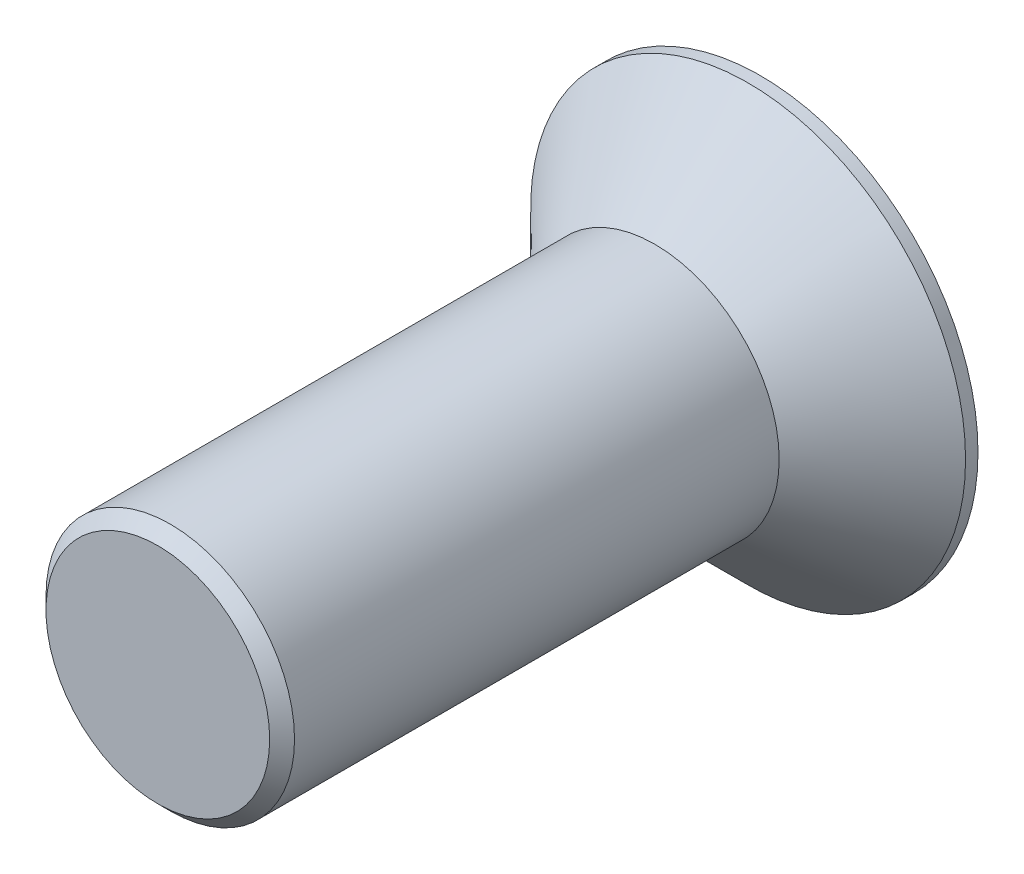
from build123d import *

# Parameters (mm, degrees)
SKETCH1_R      = 2
EXTRUDE1_DEPTH = 8
CHAMFER1_SIZE  = 0.2
SKETCH4_W      = 0.5
SKETCH4_H      = 6.200398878
EXTRUDE2_DEPTH = 0.5


with BuildPart() as part:
    # Sketch1 → Extrude1 (new body)
    with BuildSketch(Plane.XY):
        Circle(SKETCH1_R)
    extrude(amount=EXTRUDE1_DEPTH)

    # Chamfer1
    chamfer1_edges = [part.edges().sort_by_distance(p)[0] for p in [
        (-2, 0, 8),
    ]]
    chamfer(chamfer1_edges, length=CHAMFER1_SIZE)

    # Sketch3 → Revolve1 (revolve)
    with BuildSketch(Plane(origin=(0, 0, 0), x_dir=(1, 0, 0), z_dir=(0, 1, 0)), mode=Mode.PRIVATE) as revolve1_sk:
        Polygon((-2, 0), (-3.5, 1.5), (-3.5, 1.7), (0, 1.7), (0, 0), align=None)
    revolve(revolve1_sk.sketch.rotate(Axis((0, 0, 0), (0, 0, -1)), 180), axis=Axis((0, 0, 0), (0, 0, -1)))

    # Sketch4 → Extrude2 (cut)
    with BuildSketch(Plane(origin=(0, 0, -1.7), x_dir=(-1, 0, 0), z_dir=(0, 0, -1))):
        Rectangle(SKETCH4_W, SKETCH4_H)
    extrude(amount=-EXTRUDE2_DEPTH, mode=Mode.SUBTRACT)


solid = part.part
